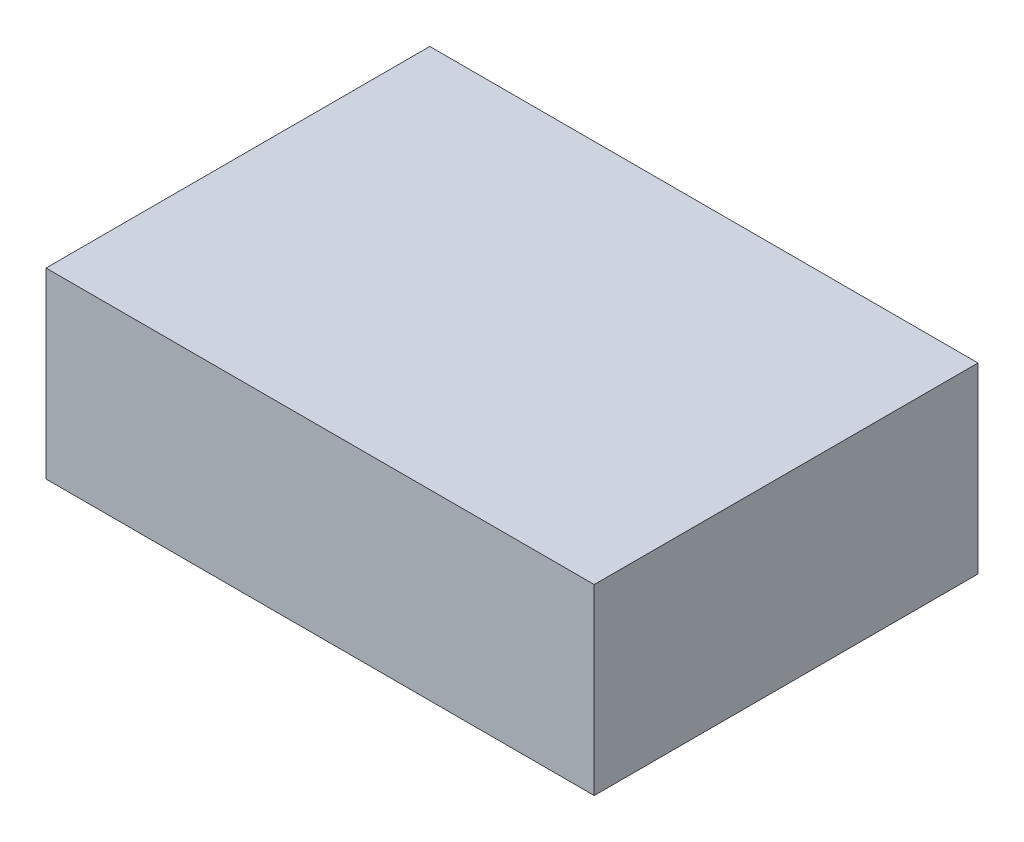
ISO-10303-21;
HEADER;
FILE_DESCRIPTION(('STEP AP214'),'2;1');
FILE_NAME('part.step','',(''),(''),'','','');
FILE_SCHEMA(('AUTOMOTIVE_DESIGN { 1 0 10303 214 1 1 1 1 }'));
ENDSEC;
DATA;
#1=APPLICATION_CONTEXT('core data for automotive mechanical design processes');
#2=APPLICATION_PROTOCOL_DEFINITION('international standard','automotive_design',2000,#1);
#3=PRODUCT_CONTEXT('',#1,'mechanical');
#4=PRODUCT('Part','Part','',(#3));
#5=PRODUCT_RELATED_PRODUCT_CATEGORY('part','',(#4));
#6=PRODUCT_DEFINITION_FORMATION('','',#4);
#7=PRODUCT_DEFINITION_CONTEXT('part definition',#1,'design');
#8=PRODUCT_DEFINITION('design','',#6,#7);
#9=PRODUCT_DEFINITION_SHAPE('','',#8);
#10=(LENGTH_UNIT() NAMED_UNIT(*) SI_UNIT(.MILLI.,.METRE.));
#11=(NAMED_UNIT(*) PLANE_ANGLE_UNIT() SI_UNIT($,.RADIAN.));
#12=(NAMED_UNIT(*) SI_UNIT($,.STERADIAN.) SOLID_ANGLE_UNIT());
#13=UNCERTAINTY_MEASURE_WITH_UNIT(LENGTH_MEASURE(1.E-05),#10,'distance_accuracy_value','');
#14=(GEOMETRIC_REPRESENTATION_CONTEXT(3) GLOBAL_UNCERTAINTY_ASSIGNED_CONTEXT((#13)) GLOBAL_UNIT_ASSIGNED_CONTEXT((#10,
#11,#12)) REPRESENTATION_CONTEXT('',''));
#15=CARTESIAN_POINT('',(0.,0.,0.));
#16=DIRECTION('',(0.,0.,1.));
#17=DIRECTION('',(1.,0.,0.));
#18=AXIS2_PLACEMENT_3D('',#15,#16,#17);
#19=CARTESIAN_POINT('',(-356.20819862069,50.8,-67.5142510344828));
#20=DIRECTION('',(1.,0.,0.));
#21=DIRECTION('',(0.,0.,-1.));
#22=AXIS2_PLACEMENT_3D('',#19,#20,#21);
#23=PLANE('',#22);
#24=DIRECTION('',(0.,0.,1.));
#25=VECTOR('',#24,1.);
#26=CARTESIAN_POINT('',(-356.20819862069,0.,-67.5142510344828));
#27=LINE('',#26,#25);
#28=CARTESIAN_POINT('',(-356.20819862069,0.,-67.5142510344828));
#29=VERTEX_POINT('',#28);
#30=CARTESIAN_POINT('',(-356.20819862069,0.,39.1657489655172));
#31=VERTEX_POINT('',#30);
#32=EDGE_CURVE('E76',#29,#31,#27,.T.);
#33=ORIENTED_EDGE('',*,*,#32,.T.);
#34=DIRECTION('',(0.,-1.,0.));
#35=VECTOR('',#34,1.);
#36=CARTESIAN_POINT('',(-356.20819862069,50.8,39.1657489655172));
#37=LINE('',#36,#35);
#38=CARTESIAN_POINT('',(-356.20819862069,50.8,39.1657489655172));
#39=VERTEX_POINT('',#38);
#40=EDGE_CURVE('E11',#39,#31,#37,.T.);
#41=ORIENTED_EDGE('',*,*,#40,.F.);
#42=DIRECTION('',(0.,0.,1.));
#43=VECTOR('',#42,1.);
#44=CARTESIAN_POINT('',(-356.20819862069,50.8,-67.5142510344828));
#45=LINE('',#44,#43);
#46=CARTESIAN_POINT('',(-356.20819862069,50.8,-67.5142510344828));
#47=VERTEX_POINT('',#46);
#48=EDGE_CURVE('E94',#47,#39,#45,.T.);
#49=ORIENTED_EDGE('',*,*,#48,.F.);
#50=DIRECTION('',(0.,-1.,0.));
#51=VECTOR('',#50,1.);
#52=CARTESIAN_POINT('',(-356.20819862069,50.8,-67.5142510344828));
#53=LINE('',#52,#51);
#54=EDGE_CURVE('E88',#47,#29,#53,.T.);
#55=ORIENTED_EDGE('',*,*,#54,.T.);
#56=EDGE_LOOP('',(#33,#41,#49,#55));
#57=FACE_BOUND('',#56,.T.);
#58=ADVANCED_FACE('F32',(#57),#23,.F.);
#59=CARTESIAN_POINT('',(-356.20819862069,50.8,39.1657489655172));
#60=DIRECTION('',(0.,0.,-1.));
#61=DIRECTION('',(-1.,0.,0.));
#62=AXIS2_PLACEMENT_3D('',#59,#60,#61);
#63=PLANE('',#62);
#64=DIRECTION('',(1.,0.,0.));
#65=VECTOR('',#64,1.);
#66=CARTESIAN_POINT('',(-356.20819862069,0.,39.1657489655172));
#67=LINE('',#66,#65);
#68=CARTESIAN_POINT('',(-203.80819862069,0.,39.1657489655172));
#69=VERTEX_POINT('',#68);
#70=EDGE_CURVE('E72',#31,#69,#67,.T.);
#71=ORIENTED_EDGE('',*,*,#70,.T.);
#72=DIRECTION('',(0.,-1.,0.));
#73=VECTOR('',#72,1.);
#74=CARTESIAN_POINT('',(-203.80819862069,50.8,39.1657489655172));
#75=LINE('',#74,#73);
#76=CARTESIAN_POINT('',(-203.80819862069,50.8,39.1657489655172));
#77=VERTEX_POINT('',#76);
#78=EDGE_CURVE('E39',#77,#69,#75,.T.);
#79=ORIENTED_EDGE('',*,*,#78,.F.);
#80=DIRECTION('',(1.,0.,0.));
#81=VECTOR('',#80,1.);
#82=CARTESIAN_POINT('',(-356.20819862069,50.8,39.1657489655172));
#83=LINE('',#82,#81);
#84=EDGE_CURVE('E84',#39,#77,#83,.T.);
#85=ORIENTED_EDGE('',*,*,#84,.F.);
#86=ORIENTED_EDGE('',*,*,#40,.T.);
#87=EDGE_LOOP('',(#71,#79,#85,#86));
#88=FACE_BOUND('',#87,.T.);
#89=ADVANCED_FACE('F83',(#88),#63,.F.);
#90=CARTESIAN_POINT('',(-203.80819862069,50.8,-67.5142510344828));
#91=DIRECTION('',(-1.,0.,0.));
#92=DIRECTION('',(0.,0.,1.));
#93=AXIS2_PLACEMENT_3D('',#90,#91,#92);
#94=PLANE('',#93);
#95=DIRECTION('',(0.,0.,-1.));
#96=VECTOR('',#95,1.);
#97=CARTESIAN_POINT('',(-203.80819862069,0.,-67.5142510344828));
#98=LINE('',#97,#96);
#99=CARTESIAN_POINT('',(-203.80819862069,0.,-67.5142510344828));
#100=VERTEX_POINT('',#99);
#101=EDGE_CURVE('E77',#69,#100,#98,.T.);
#102=ORIENTED_EDGE('',*,*,#101,.T.);
#103=DIRECTION('',(0.,-1.,0.));
#104=VECTOR('',#103,1.);
#105=CARTESIAN_POINT('',(-203.80819862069,50.8,-67.5142510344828));
#106=LINE('',#105,#104);
#107=CARTESIAN_POINT('',(-203.80819862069,50.8,-67.5142510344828));
#108=VERTEX_POINT('',#107);
#109=EDGE_CURVE('E100',#108,#100,#106,.T.);
#110=ORIENTED_EDGE('',*,*,#109,.F.);
#111=DIRECTION('',(0.,0.,-1.));
#112=VECTOR('',#111,1.);
#113=CARTESIAN_POINT('',(-203.80819862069,50.8,-67.5142510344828));
#114=LINE('',#113,#112);
#115=EDGE_CURVE('E51',#77,#108,#114,.T.);
#116=ORIENTED_EDGE('',*,*,#115,.F.);
#117=ORIENTED_EDGE('',*,*,#78,.T.);
#118=EDGE_LOOP('',(#102,#110,#116,#117));
#119=FACE_BOUND('',#118,.T.);
#120=ADVANCED_FACE('F103',(#119),#94,.F.);
#121=CARTESIAN_POINT('',(-356.20819862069,50.8,-67.5142510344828));
#122=DIRECTION('',(0.,0.,1.));
#123=DIRECTION('',(1.,0.,0.));
#124=AXIS2_PLACEMENT_3D('',#121,#122,#123);
#125=PLANE('',#124);
#126=DIRECTION('',(-1.,0.,0.));
#127=VECTOR('',#126,1.);
#128=CARTESIAN_POINT('',(-356.20819862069,0.,-67.5142510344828));
#129=LINE('',#128,#127);
#130=EDGE_CURVE('E92',#100,#29,#129,.T.);
#131=ORIENTED_EDGE('',*,*,#130,.T.);
#132=ORIENTED_EDGE('',*,*,#54,.F.);
#133=DIRECTION('',(-1.,0.,0.));
#134=VECTOR('',#133,1.);
#135=CARTESIAN_POINT('',(-356.20819862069,50.8,-67.5142510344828));
#136=LINE('',#135,#134);
#137=EDGE_CURVE('E46',#108,#47,#136,.T.);
#138=ORIENTED_EDGE('',*,*,#137,.F.);
#139=ORIENTED_EDGE('',*,*,#109,.T.);
#140=EDGE_LOOP('',(#131,#132,#138,#139));
#141=FACE_BOUND('',#140,.T.);
#142=ADVANCED_FACE('F105',(#141),#125,.F.);
#143=CARTESIAN_POINT('',(-356.20819862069,50.8,39.1657489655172));
#144=DIRECTION('',(0.,1.,0.));
#145=DIRECTION('',(0.,0.,1.));
#146=AXIS2_PLACEMENT_3D('',#143,#144,#145);
#147=PLANE('',#146);
#148=ORIENTED_EDGE('',*,*,#48,.T.);
#149=ORIENTED_EDGE('',*,*,#84,.T.);
#150=ORIENTED_EDGE('',*,*,#115,.T.);
#151=ORIENTED_EDGE('',*,*,#137,.T.);
#152=EDGE_LOOP('',(#148,#149,#150,#151));
#153=FACE_BOUND('',#152,.T.);
#154=ADVANCED_FACE('F106',(#153),#147,.T.);
#155=CARTESIAN_POINT('',(-356.20819862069,0.,39.1657489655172));
#156=DIRECTION('',(0.,1.,0.));
#157=DIRECTION('',(0.,0.,1.));
#158=AXIS2_PLACEMENT_3D('',#155,#156,#157);
#159=PLANE('',#158);
#160=ORIENTED_EDGE('',*,*,#32,.F.);
#161=ORIENTED_EDGE('',*,*,#130,.F.);
#162=ORIENTED_EDGE('',*,*,#101,.F.);
#163=ORIENTED_EDGE('',*,*,#70,.F.);
#164=EDGE_LOOP('',(#160,#161,#162,#163));
#165=FACE_BOUND('',#164,.T.);
#166=ADVANCED_FACE('F73',(#165),#159,.F.);
#167=CLOSED_SHELL('',(#58,#89,#120,#142,#154,#166));
#168=MANIFOLD_SOLID_BREP('B2',#167);
#169=ADVANCED_BREP_SHAPE_REPRESENTATION('',(#18,#168),#14);
#170=SHAPE_DEFINITION_REPRESENTATION(#9,#169);
ENDSEC;
END-ISO-10303-21;
